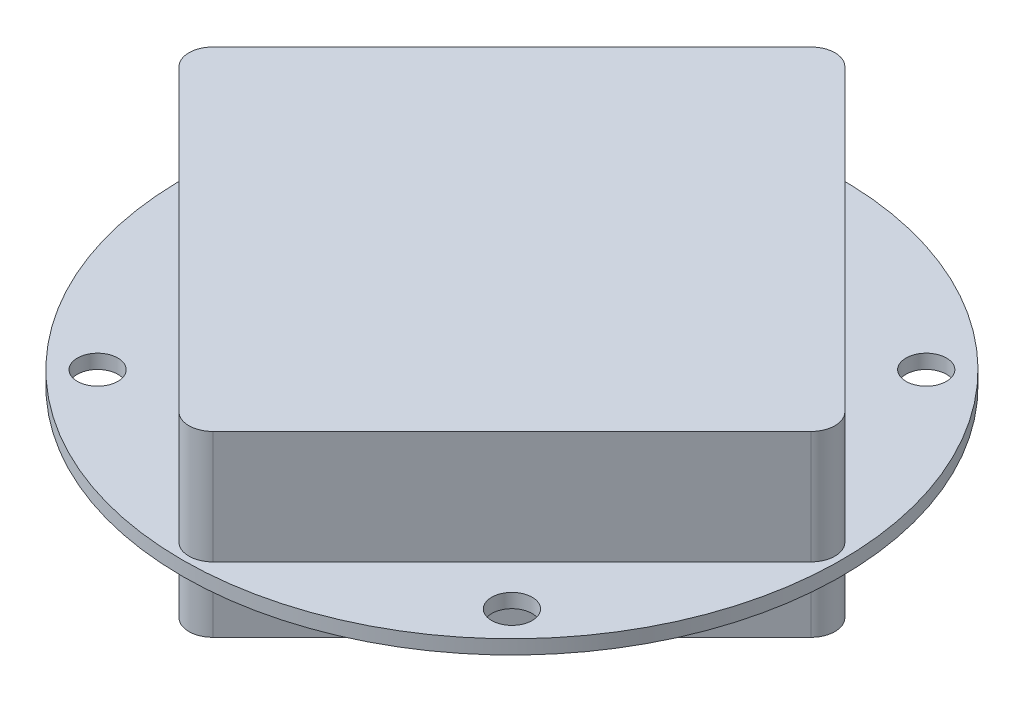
from build123d import *

# Parameters (mm, degrees)
SKETCH1_R                    = 17.5
BOSS_EXTRUDE1_DEPTH          = 0.75
BOSS_EXTRUDE2_DEPTH          = 6
BOSS_EXTRUDE3_START          = 2.72
BOSS_EXTRUDE3_DEPTH          = 2.72
F_2_15_2_15_DIAMETER_HOLE1_D = 2.15


with BuildPart() as part:
    # Sketch1 → Boss-Extrude1 (new body)
    with BuildSketch(Plane(origin=(0, 0, 0), x_dir=(1, 0, 0), z_dir=(0, 1, 0))):
        with Locations(Location((0, 0, 0), (0, 0, 270))):
            Circle(SKETCH1_R)
    extrude(amount=BOSS_EXTRUDE1_DEPTH)

    # Sketch2 → Boss-Extrude2 (add)
    with BuildSketch(Plane(origin=(0, 0.75, 0), x_dir=(1, 0, 0), z_dir=(0, 1, 0))):
        with BuildLine():
            Line((-16.779643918, 0.898025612), (-0.898025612, 16.779643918))
            ThreePointArc((-0.898025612, 16.779643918), (0, 17.151618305), (0.898025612, 16.779643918))
            Line((0.898025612, 16.779643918), (16.779643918, 0.898025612))
            ThreePointArc((16.779643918, 0.898025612), (17.151618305, 0), (16.779643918, -0.898025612))
            Line((16.779643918, -0.898025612), (0.898025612, -16.779643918))
            ThreePointArc((0.898025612, -16.779643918), (0, -17.151618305), (-0.898025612, -16.779643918))
            Line((-0.898025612, -16.779643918), (-16.779643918, -0.898025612))
            ThreePointArc((-16.779643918, -0.898025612), (-17.151618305, 0), (-16.779643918, 0.898025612))
        make_face()
    extrude(amount=BOSS_EXTRUDE2_DEPTH)

    # Sketch3 → Boss-Extrude3 (add)
    with BuildSketch(Plane.XZ.offset(BOSS_EXTRUDE3_START)):
        with BuildLine():
            Line((16.779643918, -0.898025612), (0.898025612, -16.779643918))
            ThreePointArc((0.898025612, -16.779643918), (0, -17.151618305), (-0.898025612, -16.779643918))
            Line((-0.898025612, -16.779643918), (-16.779643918, -0.898025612))
            ThreePointArc((-16.779643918, -0.898025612), (-17.151618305, 0), (-16.779643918, 0.898025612))
            Line((-16.779643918, 0.898025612), (-0.898025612, 16.779643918))
            ThreePointArc((-0.898025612, 16.779643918), (0, 17.151618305), (0.898025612, 16.779643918))
            Line((0.898025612, 16.779643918), (16.779643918, 0.898025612))
            ThreePointArc((16.779643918, 0.898025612), (17.151618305, 0), (16.779643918, -0.898025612))
        make_face()
    extrude(amount=-BOSS_EXTRUDE3_DEPTH)

    # 2.15 _2.15_ Diameter Hole1 (through all)
    with Locations(Plane(origin=(0, 0.75, 0), x_dir=(1, 0, 0), z_dir=(0, 1, 0))):
        with Locations((-11, 11), (11, 11), (11, -11), (-11, -11)):
            Hole(F_2_15_2_15_DIAMETER_HOLE1_D / 2)


solid = part.part
